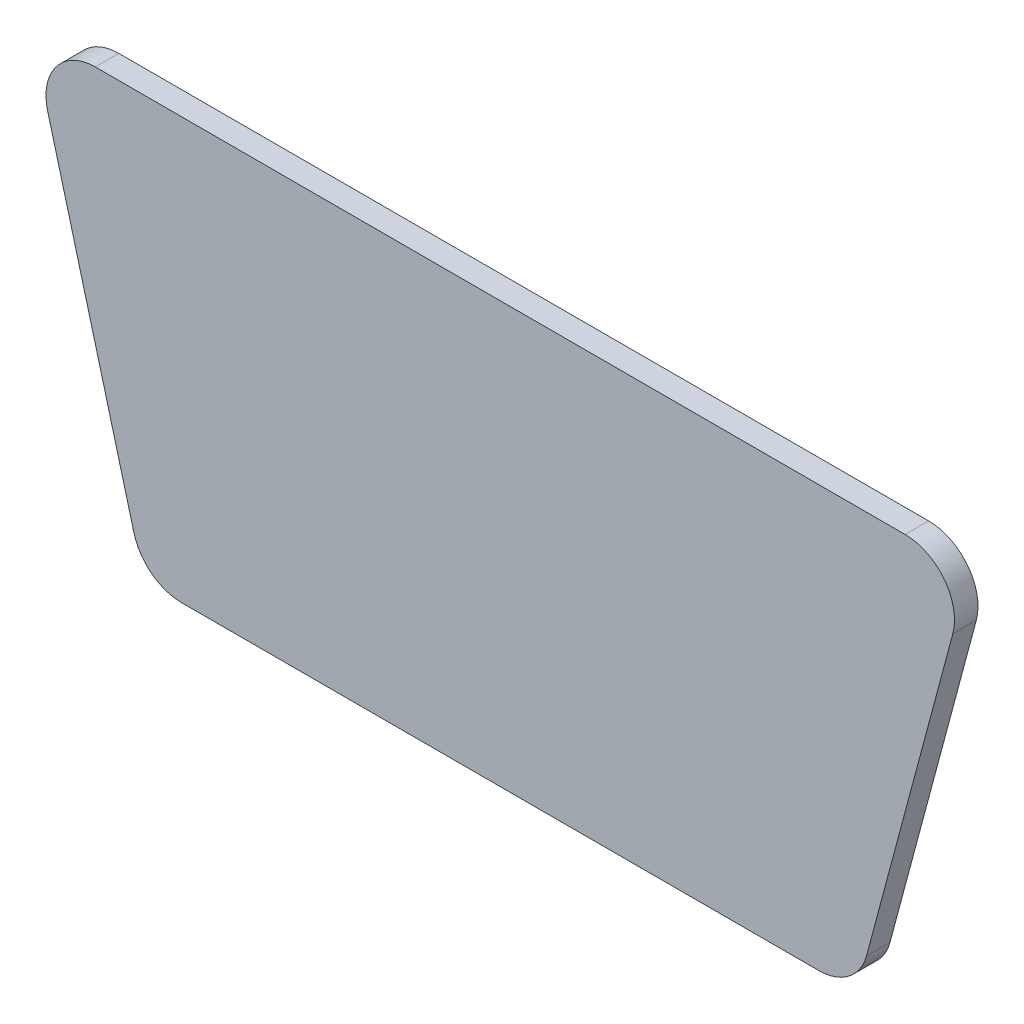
from build123d import *

# Parameters (mm, degrees)
BOSS_EXTRUDE1_DEPTH = 0.5


with BuildPart() as part:
    # Sketch1 → Boss-Extrude1 (new body)
    with BuildSketch(Plane.XY):
        with BuildLine():
            Line((-8.611007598, 4.475), (8.611007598, 4.475))
            ThreePointArc((8.611007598, 4.475), (9.444028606, 4.0641995), (9.625229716, 3.153240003))
            Line((9.625229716, 3.153240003), (7.789777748, -3.696759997))
            ThreePointArc((7.789777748, -3.696759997), (7.414755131, -4.258021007), (6.77555563, -4.475))
            Line((6.77555563, -4.475), (-6.77555563, -4.475))
            ThreePointArc((-6.77555563, -4.475), (-7.414755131, -4.258021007), (-7.789777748, -3.696759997))
            Line((-7.789777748, -3.696759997), (-9.625229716, 3.153240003))
            ThreePointArc((-9.625229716, 3.153240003), (-9.444028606, 4.0641995), (-8.611007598, 4.475))
        make_face()
    extrude(amount=BOSS_EXTRUDE1_DEPTH)


solid = part.part
